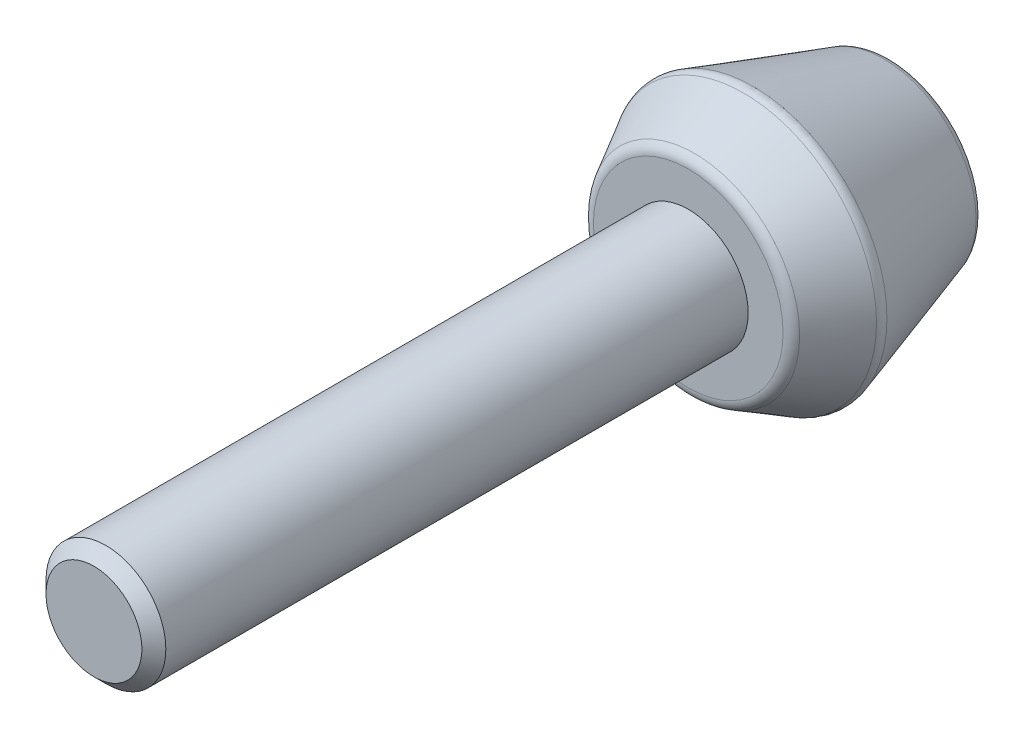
ISO-10303-21;
HEADER;
FILE_DESCRIPTION(('STEP AP214'),'2;1');
FILE_NAME('part.step','',(''),(''),'','','');
FILE_SCHEMA(('AUTOMOTIVE_DESIGN { 1 0 10303 214 1 1 1 1 }'));
ENDSEC;
DATA;
#1=APPLICATION_CONTEXT('core data for automotive mechanical design processes');
#2=APPLICATION_PROTOCOL_DEFINITION('international standard','automotive_design',2000,#1);
#3=PRODUCT_CONTEXT('',#1,'mechanical');
#4=PRODUCT('Part','Part','',(#3));
#5=PRODUCT_RELATED_PRODUCT_CATEGORY('part','',(#4));
#6=PRODUCT_DEFINITION_FORMATION('','',#4);
#7=PRODUCT_DEFINITION_CONTEXT('part definition',#1,'design');
#8=PRODUCT_DEFINITION('design','',#6,#7);
#9=PRODUCT_DEFINITION_SHAPE('','',#8);
#10=(LENGTH_UNIT() NAMED_UNIT(*) SI_UNIT(.MILLI.,.METRE.));
#11=(NAMED_UNIT(*) PLANE_ANGLE_UNIT() SI_UNIT($,.RADIAN.));
#12=(NAMED_UNIT(*) SI_UNIT($,.STERADIAN.) SOLID_ANGLE_UNIT());
#13=UNCERTAINTY_MEASURE_WITH_UNIT(LENGTH_MEASURE(1.E-05),#10,'distance_accuracy_value','');
#14=(GEOMETRIC_REPRESENTATION_CONTEXT(3) GLOBAL_UNCERTAINTY_ASSIGNED_CONTEXT((#13)) GLOBAL_UNIT_ASSIGNED_CONTEXT((#10,
#11,#12)) REPRESENTATION_CONTEXT('',''));
#15=CARTESIAN_POINT('',(0.,0.,0.));
#16=DIRECTION('',(0.,0.,1.));
#17=DIRECTION('',(1.,0.,0.));
#18=AXIS2_PLACEMENT_3D('',#15,#16,#17);
#19=CARTESIAN_POINT('',(0.,0.,2.));
#20=DIRECTION('',(0.,0.,1.));
#21=DIRECTION('',(1.,-2.23741544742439E-13,0.));
#22=AXIS2_PLACEMENT_3D('',#19,#20,#21);
#23=CYLINDRICAL_SURFACE('',#22,2.5);
#24=CARTESIAN_POINT('',(0.,0.,32.8));
#25=DIRECTION('',(0.,0.,1.));
#26=DIRECTION('',(1.,-2.23741544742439E-13,0.));
#27=AXIS2_PLACEMENT_3D('',#24,#25,#26);
#28=CIRCLE('',#27,2.5);
#29=CARTESIAN_POINT('',(2.50000000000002,-5.8017054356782E-13,32.8));
#30=VERTEX_POINT('',#29);
#31=EDGE_CURVE('E148',#30,#30,#28,.F.);
#32=ORIENTED_EDGE('',*,*,#31,.T.);
#33=EDGE_LOOP('',(#32));
#34=FACE_BOUND('',#33,.T.);
#35=CARTESIAN_POINT('',(0.,0.,8.5));
#36=DIRECTION('',(0.,0.,1.));
#37=DIRECTION('',(1.,-2.23741544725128E-13,0.));
#38=AXIS2_PLACEMENT_3D('',#35,#36,#37);
#39=CIRCLE('',#38,2.5);
#40=CARTESIAN_POINT('',(2.49999999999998,-5.24659392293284E-13,8.5));
#41=VERTEX_POINT('',#40);
#42=EDGE_CURVE('E49',#41,#41,#39,.T.);
#43=ORIENTED_EDGE('',*,*,#42,.T.);
#44=EDGE_LOOP('',(#43));
#45=FACE_BOUND('',#44,.T.);
#46=ADVANCED_FACE('F14',(#34,#45),#23,.T.);
#47=CARTESIAN_POINT('',(0.,0.,32.8000000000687));
#48=DIRECTION('',(0.,0.,-1.));
#49=DIRECTION('',(-1.,2.23741544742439E-13,0.));
#50=AXIS2_PLACEMENT_3D('',#47,#48,#49);
#51=CONICAL_SURFACE('',#50,2.49999999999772,0.785398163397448);
#52=ORIENTED_EDGE('',*,*,#31,.F.);
#53=EDGE_LOOP('',(#52));
#54=FACE_BOUND('',#53,.T.);
#55=CARTESIAN_POINT('',(0.,0.,33.3000000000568));
#56=DIRECTION('',(0.,0.,-1.));
#57=DIRECTION('',(-1.,2.23741544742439E-13,0.));
#58=AXIS2_PLACEMENT_3D('',#55,#56,#57);
#59=CIRCLE('',#58,2.00000000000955);
#60=CARTESIAN_POINT('',(-2.00000000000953,4.37074748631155E-13,33.3000000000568));
#61=VERTEX_POINT('',#60);
#62=EDGE_CURVE('E18',#61,#61,#59,.T.);
#63=ORIENTED_EDGE('',*,*,#62,.T.);
#64=EDGE_LOOP('',(#63));
#65=FACE_BOUND('',#64,.T.);
#66=ADVANCED_FACE('F161',(#54,#65),#51,.T.);
#67=CARTESIAN_POINT('',(0.,0.,33.3));
#68=DIRECTION('',(0.,0.,-1.));
#69=DIRECTION('',(-1.,2.23741544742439E-13,0.));
#70=AXIS2_PLACEMENT_3D('',#67,#68,#69);
#71=PLANE('',#70);
#72=ORIENTED_EDGE('',*,*,#62,.F.);
#73=EDGE_LOOP('',(#72));
#74=FACE_BOUND('',#73,.T.);
#75=ADVANCED_FACE('F16',(#74),#71,.F.);
#76=CARTESIAN_POINT('',(0.,0.,8.5));
#77=DIRECTION('',(0.,0.,-1.));
#78=DIRECTION('',(-1.,2.23741544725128E-13,0.));
#79=AXIS2_PLACEMENT_3D('',#76,#77,#78);
#80=PLANE('',#79);
#81=ORIENTED_EDGE('',*,*,#42,.F.);
#82=EDGE_LOOP('',(#81));
#83=FACE_BOUND('',#82,.T.);
#84=CARTESIAN_POINT('',(0.,0.,8.5));
#85=DIRECTION('',(0.,0.,-1.));
#86=DIRECTION('',(-1.,2.23584236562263E-13,0.));
#87=AXIS2_PLACEMENT_3D('',#84,#85,#86);
#88=CIRCLE('',#87,3.95693804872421);
#89=CARTESIAN_POINT('',(-3.95693804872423,9.19403442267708E-13,8.5));
#90=VERTEX_POINT('',#89);
#91=CARTESIAN_POINT('',(3.95693804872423,-8.50014503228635E-13,8.5));
#92=VERTEX_POINT('',#91);
#93=EDGE_CURVE('E41',#90,#92,#88,.T.);
#94=ORIENTED_EDGE('',*,*,#93,.F.);
#95=CARTESIAN_POINT('',(0.,0.,8.5));
#96=DIRECTION('',(0.,0.,-1.));
#97=DIRECTION('',(1.,-2.25682217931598E-13,0.));
#98=AXIS2_PLACEMENT_3D('',#95,#96,#97);
#99=CIRCLE('',#98,3.95693804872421);
#100=EDGE_CURVE('E44',#92,#90,#99,.T.);
#101=ORIENTED_EDGE('',*,*,#100,.F.);
#102=EDGE_LOOP('',(#94,#101));
#103=FACE_BOUND('',#102,.T.);
#104=ADVANCED_FACE('F46',(#83,#103),#80,.F.);
#105=CARTESIAN_POINT('',(0.,0.,8.));
#106=DIRECTION('',(0.,0.,-1.));
#107=DIRECTION('',(-1.,2.23584236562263E-13,0.));
#108=AXIS2_PLACEMENT_3D('',#105,#106,#107);
#109=TOROIDAL_SURFACE('',#108,3.9569380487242,0.5);
#110=CARTESIAN_POINT('',(0.,0.,8.2443016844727));
#111=DIRECTION('',(0.,0.,-1.));
#112=DIRECTION('',(-1.,2.23741544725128E-13,0.));
#113=AXIS2_PLACEMENT_3D('',#110,#111,#112);
#114=CIRCLE('',#113,4.39319105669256);
#115=CARTESIAN_POINT('',(-4.39319105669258,9.76000459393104E-13,8.2443016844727));
#116=VERTEX_POINT('',#115);
#117=EDGE_CURVE('E54',#116,#116,#114,.T.);
#118=ORIENTED_EDGE('',*,*,#117,.F.);
#119=EDGE_LOOP('',(#118));
#120=FACE_BOUND('',#119,.T.);
#121=ORIENTED_EDGE('',*,*,#93,.T.);
#122=ORIENTED_EDGE('',*,*,#100,.T.);
#123=EDGE_LOOP('',(#121,#122));
#124=FACE_BOUND('',#123,.T.);
#125=ADVANCED_FACE('F53',(#120,#124),#109,.T.);
#126=CARTESIAN_POINT('',(0.,0.,6.18887432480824));
#127=DIRECTION('',(0.,0.,-1.));
#128=DIRECTION('',(-1.,2.23741544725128E-13,0.));
#129=AXIS2_PLACEMENT_3D('',#126,#127,#128);
#130=CONICAL_SURFACE('',#129,5.54423037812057,0.510488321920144);
#131=CARTESIAN_POINT('',(0.,0.,6.18887432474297));
#132=DIRECTION('',(0.,0.,1.));
#133=DIRECTION('',(1.,-2.23741544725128E-13,0.));
#134=AXIS2_PLACEMENT_3D('',#131,#132,#133);
#135=CIRCLE('',#134,5.54423037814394);
#136=CARTESIAN_POINT('',(5.54423037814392,-1.25088300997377E-12,6.18887432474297));
#137=VERTEX_POINT('',#136);
#138=EDGE_CURVE('E92',#137,#137,#135,.F.);
#139=ORIENTED_EDGE('',*,*,#138,.F.);
#140=EDGE_LOOP('',(#139));
#141=FACE_BOUND('',#140,.T.);
#142=ORIENTED_EDGE('',*,*,#117,.T.);
#143=EDGE_LOOP('',(#142));
#144=FACE_BOUND('',#143,.T.);
#145=ADVANCED_FACE('F73',(#141,#144),#130,.T.);
#146=CARTESIAN_POINT('',(0.,0.,5.94457264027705));
#147=DIRECTION('',(0.,0.,1.));
#148=DIRECTION('',(1.,-2.23463802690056E-13,0.));
#149=AXIS2_PLACEMENT_3D('',#146,#147,#148);
#150=TOROIDAL_SURFACE('',#149,5.1079773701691,0.5);
#151=ORIENTED_EDGE('',*,*,#138,.T.);
#152=EDGE_LOOP('',(#151));
#153=FACE_BOUND('',#152,.T.);
#154=CARTESIAN_POINT('',(0.,0.,5.79362678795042));
#155=DIRECTION('',(0.,0.,1.));
#156=DIRECTION('',(1.,-2.23741544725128E-13,0.));
#157=AXIS2_PLACEMENT_3D('',#154,#155,#156);
#158=CIRCLE('',#157,5.58464848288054);
#159=CARTESIAN_POINT('',(5.58464848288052,-1.22870119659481E-12,5.79362678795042));
#160=VERTEX_POINT('',#159);
#161=EDGE_CURVE('E9',#160,#160,#158,.F.);
#162=ORIENTED_EDGE('',*,*,#161,.F.);
#163=EDGE_LOOP('',(#162));
#164=FACE_BOUND('',#163,.T.);
#165=ADVANCED_FACE('F110',(#153,#164),#150,.T.);
#166=CARTESIAN_POINT('',(0.,0.,5.79362678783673));
#167=DIRECTION('',(0.,0.,1.));
#168=DIRECTION('',(1.,-2.23741544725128E-13,0.));
#169=AXIS2_PLACEMENT_3D('',#166,#167,#168);
#170=CONICAL_SURFACE('',#169,5.58464848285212,0.306676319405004);
#171=ORIENTED_EDGE('',*,*,#161,.T.);
#172=EDGE_LOOP('',(#171));
#173=FACE_BOUND('',#172,.T.);
#174=CARTESIAN_POINT('',(0.,0.,0.349054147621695));
#175=DIRECTION('',(0.,0.,1.));
#176=DIRECTION('',(1.,-2.23741544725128E-13,0.));
#177=AXIS2_PLACEMENT_3D('',#174,#175,#176);
#178=CIRCLE('',#177,3.86053381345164);
#179=CARTESIAN_POINT('',(3.86053381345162,-8.42945117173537E-13,0.349054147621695));
#180=VERTEX_POINT('',#179);
#181=EDGE_CURVE('E24',#180,#180,#178,.T.);
#182=ORIENTED_EDGE('',*,*,#181,.T.);
#183=EDGE_LOOP('',(#182));
#184=FACE_BOUND('',#183,.T.);
#185=ADVANCED_FACE('F108',(#173,#184),#170,.T.);
#186=CARTESIAN_POINT('',(0.,0.,0.5));
#187=DIRECTION('',(0.,0.,-1.));
#188=DIRECTION('',(-1.,2.23513629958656E-13,0.));
#189=AXIS2_PLACEMENT_3D('',#186,#187,#188);
#190=TOROIDAL_SURFACE('',#189,3.383862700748,0.5);
#191=CARTESIAN_POINT('',(0.,0.,0.));
#192=DIRECTION('',(0.,0.,1.));
#193=DIRECTION('',(-1.,2.27709592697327E-13,0.));
#194=AXIS2_PLACEMENT_3D('',#191,#192,#193);
#195=CIRCLE('',#194,3.383862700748);
#196=CARTESIAN_POINT('',(-3.38386270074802,7.84095011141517E-13,0.));
#197=VERTEX_POINT('',#196);
#198=CARTESIAN_POINT('',(3.38386270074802,-7.28583859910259E-13,0.));
#199=VERTEX_POINT('',#198);
#200=EDGE_CURVE('E32',#197,#199,#195,.T.);
#201=ORIENTED_EDGE('',*,*,#200,.T.);
#202=CARTESIAN_POINT('',(0.,0.,0.));
#203=DIRECTION('',(0.,0.,1.));
#204=DIRECTION('',(1.,-2.25611611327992E-13,0.));
#205=AXIS2_PLACEMENT_3D('',#202,#203,#204);
#206=CIRCLE('',#205,3.383862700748);
#207=EDGE_CURVE('E120',#199,#197,#206,.T.);
#208=ORIENTED_EDGE('',*,*,#207,.T.);
#209=EDGE_LOOP('',(#201,#208));
#210=FACE_BOUND('',#209,.T.);
#211=ORIENTED_EDGE('',*,*,#181,.F.);
#212=EDGE_LOOP('',(#211));
#213=FACE_BOUND('',#212,.T.);
#214=ADVANCED_FACE('F98',(#210,#213),#190,.T.);
#215=CARTESIAN_POINT('',(0.,0.,0.));
#216=DIRECTION('',(0.,0.,-1.));
#217=DIRECTION('',(-1.,2.23741544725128E-13,0.));
#218=AXIS2_PLACEMENT_3D('',#215,#216,#217);
#219=PLANE('',#218);
#220=ORIENTED_EDGE('',*,*,#207,.F.);
#221=ORIENTED_EDGE('',*,*,#200,.F.);
#222=EDGE_LOOP('',(#220,#221));
#223=FACE_BOUND('',#222,.T.);
#224=ADVANCED_FACE('F75',(#223),#219,.T.);
#225=CLOSED_SHELL('',(#46,#66,#75,#104,#125,#145,#165,#185,#214,#224));
#226=MANIFOLD_SOLID_BREP('B1',#225);
#227=ADVANCED_BREP_SHAPE_REPRESENTATION('',(#18,#226),#14);
#228=SHAPE_DEFINITION_REPRESENTATION(#9,#227);
ENDSEC;
END-ISO-10303-21;
